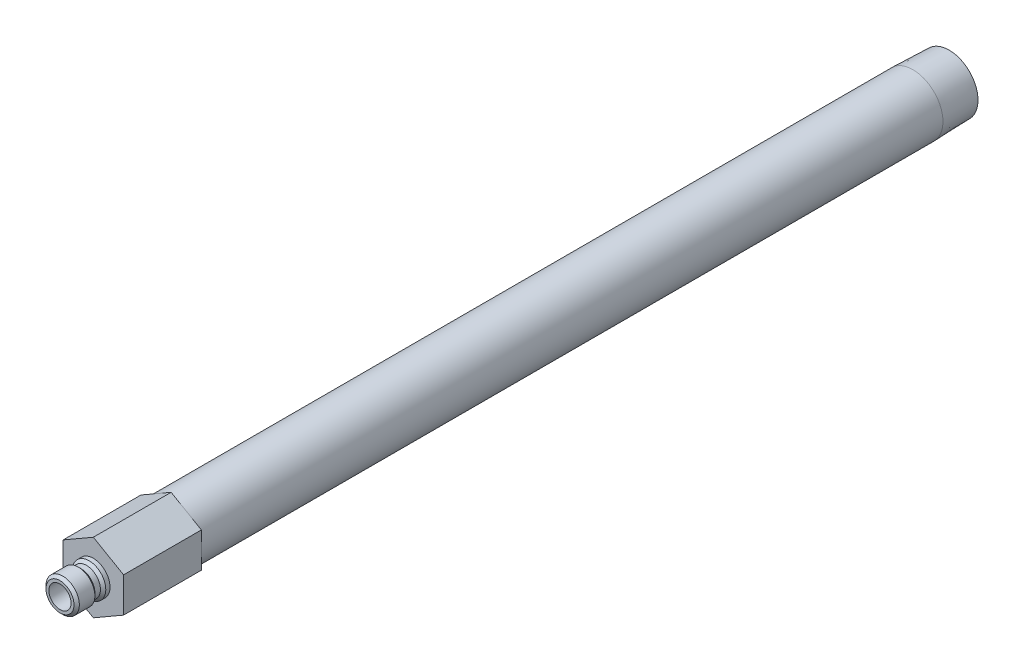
from build123d import *

# Parameters (mm, degrees)
SKETCH2_R           = 3.175
BOSS_EXTRUDE1_DEPTH = 22.225


with BuildPart() as part:
    # Sketch1 → Revolve1 (revolve)
    with BuildSketch(Plane(origin=(0, 0, 0), x_dir=(0, 0, -1), z_dir=(1, 0, 0))):
        Polygon((-9.525, 3.175), (-9.525, 4.0005), (-8.763, 4.7625), (-4.318, 4.7625), (-3.556, 4.0005), (-1.9685, 4.0005), (-1.2065, 4.7625), (0, 4.7625), (0, 8.5725), (234.1372, 8.5725), (244.475, 8.249445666), (244.475, 6.2611), (22.225, 6.2611), (22.225, 3.175), align=None)
    revolve(axis=Axis((0, 0, 0), (0, 0, 1)))

    # Sketch2 → Boss-Extrude1 (add)
    with BuildSketch(Plane.XY):
        Polygon((-8.636, 4.985996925), (-8.636, -4.985996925), (0, -9.971993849), (8.636, -4.985996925), (8.636, 4.985996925), (0, 9.971993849), align=None)
        with Locations(Location((0, 0, 0), (0, 0, 90))):
            Circle(SKETCH2_R, mode=Mode.SUBTRACT)
    extrude(amount=-BOSS_EXTRUDE1_DEPTH)


solid = part.part
